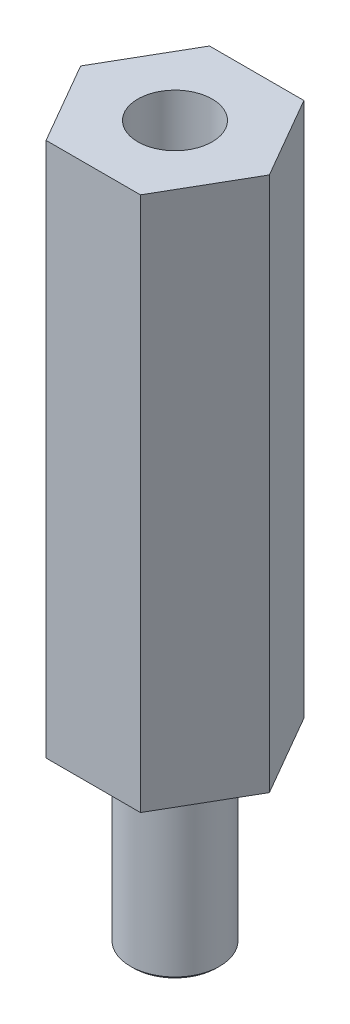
ISO-10303-21;
HEADER;
FILE_DESCRIPTION(('STEP AP214'),'2;1');
FILE_NAME('part.step','',(''),(''),'','','');
FILE_SCHEMA(('AUTOMOTIVE_DESIGN { 1 0 10303 214 1 1 1 1 }'));
ENDSEC;
DATA;
#1=APPLICATION_CONTEXT('core data for automotive mechanical design processes');
#2=APPLICATION_PROTOCOL_DEFINITION('international standard','automotive_design',2000,#1);
#3=PRODUCT_CONTEXT('',#1,'mechanical');
#4=PRODUCT('Part','Part','',(#3));
#5=PRODUCT_RELATED_PRODUCT_CATEGORY('part','',(#4));
#6=PRODUCT_DEFINITION_FORMATION('','',#4);
#7=PRODUCT_DEFINITION_CONTEXT('part definition',#1,'design');
#8=PRODUCT_DEFINITION('design','',#6,#7);
#9=PRODUCT_DEFINITION_SHAPE('','',#8);
#10=(LENGTH_UNIT() NAMED_UNIT(*) SI_UNIT(.MILLI.,.METRE.));
#11=(NAMED_UNIT(*) PLANE_ANGLE_UNIT() SI_UNIT($,.RADIAN.));
#12=(NAMED_UNIT(*) SI_UNIT($,.STERADIAN.) SOLID_ANGLE_UNIT());
#13=UNCERTAINTY_MEASURE_WITH_UNIT(LENGTH_MEASURE(1.E-05),#10,'distance_accuracy_value','');
#14=(GEOMETRIC_REPRESENTATION_CONTEXT(3) GLOBAL_UNCERTAINTY_ASSIGNED_CONTEXT((#13)) GLOBAL_UNIT_ASSIGNED_CONTEXT((#10,
#11,#12)) REPRESENTATION_CONTEXT('',''));
#15=CARTESIAN_POINT('',(0.,0.,0.));
#16=DIRECTION('',(0.,0.,1.));
#17=DIRECTION('',(1.,0.,0.));
#18=AXIS2_PLACEMENT_3D('',#15,#16,#17);
#19=CARTESIAN_POINT('',(0.,18.,0.));
#20=DIRECTION('',(0.,1.,0.));
#21=DIRECTION('',(0.,0.,1.));
#22=AXIS2_PLACEMENT_3D('',#19,#20,#21);
#23=PLANE('',#22);
#24=DIRECTION('',(0.499999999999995,0.,-0.866025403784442));
#25=VECTOR('',#24,1.);
#26=CARTESIAN_POINT('',(1.5877132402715,18.,2.74999999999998));
#27=LINE('',#26,#25);
#28=CARTESIAN_POINT('',(1.5877132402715,18.,2.74999999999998));
#29=VERTEX_POINT('',#28);
#30=CARTESIAN_POINT('',(3.17542648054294,18.,0.));
#31=VERTEX_POINT('',#30);
#32=EDGE_CURVE('E133',#29,#31,#27,.T.);
#33=ORIENTED_EDGE('',*,*,#32,.T.);
#34=DIRECTION('',(-0.500000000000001,0.,-0.866025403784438));
#35=VECTOR('',#34,1.);
#36=CARTESIAN_POINT('',(3.17542648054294,18.,0.));
#37=LINE('',#36,#35);
#38=CARTESIAN_POINT('',(1.58771324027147,18.,-2.75000000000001));
#39=VERTEX_POINT('',#38);
#40=EDGE_CURVE('E91',#31,#39,#37,.T.);
#41=ORIENTED_EDGE('',*,*,#40,.T.);
#42=DIRECTION('',(-1.,0.,0.));
#43=VECTOR('',#42,1.);
#44=CARTESIAN_POINT('',(1.58771324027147,18.,-2.75000000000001));
#45=LINE('',#44,#43);
#46=CARTESIAN_POINT('',(-1.58771324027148,18.,-2.74999999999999));
#47=VERTEX_POINT('',#46);
#48=EDGE_CURVE('E104',#39,#47,#45,.T.);
#49=ORIENTED_EDGE('',*,*,#48,.T.);
#50=DIRECTION('',(-0.499999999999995,0.,0.866025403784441));
#51=VECTOR('',#50,1.);
#52=CARTESIAN_POINT('',(-1.58771324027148,18.,-2.74999999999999));
#53=LINE('',#52,#51);
#54=CARTESIAN_POINT('',(-3.17542648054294,18.,0.));
#55=VERTEX_POINT('',#54);
#56=EDGE_CURVE('E98',#47,#55,#53,.T.);
#57=ORIENTED_EDGE('',*,*,#56,.T.);
#58=DIRECTION('',(0.500000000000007,0.,0.866025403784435));
#59=VECTOR('',#58,1.);
#60=CARTESIAN_POINT('',(-3.17542648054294,18.,0.));
#61=LINE('',#60,#59);
#62=CARTESIAN_POINT('',(-1.58771324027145,18.,2.75000000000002));
#63=VERTEX_POINT('',#62);
#64=EDGE_CURVE('E102',#55,#63,#61,.T.);
#65=ORIENTED_EDGE('',*,*,#64,.T.);
#66=DIRECTION('',(1.,0.,0.));
#67=VECTOR('',#66,1.);
#68=CARTESIAN_POINT('',(-1.58771324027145,18.,2.75000000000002));
#69=LINE('',#68,#67);
#70=EDGE_CURVE('E53',#63,#29,#69,.T.);
#71=ORIENTED_EDGE('',*,*,#70,.T.);
#72=EDGE_LOOP('',(#33,#41,#49,#57,#65,#71));
#73=FACE_BOUND('',#72,.T.);
#74=CARTESIAN_POINT('',(0.,18.,0.));
#75=DIRECTION('',(0.,1.,0.));
#76=DIRECTION('',(0.,0.,1.));
#77=AXIS2_PLACEMENT_3D('',#74,#75,#76);
#78=CIRCLE('',#77,1.25);
#79=CARTESIAN_POINT('',(0.,18.,1.25));
#80=VERTEX_POINT('',#79);
#81=EDGE_CURVE('E126',#80,#80,#78,.T.);
#82=ORIENTED_EDGE('',*,*,#81,.F.);
#83=EDGE_LOOP('',(#82));
#84=FACE_BOUND('',#83,.T.);
#85=ADVANCED_FACE('F36',(#73,#84),#23,.T.);
#86=CARTESIAN_POINT('',(0.,0.,0.));
#87=DIRECTION('',(0.,1.,0.));
#88=DIRECTION('',(0.,0.,1.));
#89=AXIS2_PLACEMENT_3D('',#86,#87,#88);
#90=PLANE('',#89);
#91=CARTESIAN_POINT('',(0.,0.,0.));
#92=DIRECTION('',(0.,1.,0.));
#93=DIRECTION('',(0.,0.,1.));
#94=AXIS2_PLACEMENT_3D('',#91,#92,#93);
#95=CIRCLE('',#94,1.5);
#96=CARTESIAN_POINT('',(0.,0.,1.5));
#97=VERTEX_POINT('',#96);
#98=EDGE_CURVE('E142',#97,#97,#95,.F.);
#99=ORIENTED_EDGE('',*,*,#98,.F.);
#100=EDGE_LOOP('',(#99));
#101=FACE_BOUND('',#100,.T.);
#102=DIRECTION('',(0.499999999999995,0.,-0.866025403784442));
#103=VECTOR('',#102,1.);
#104=CARTESIAN_POINT('',(1.5877132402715,0.,2.74999999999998));
#105=LINE('',#104,#103);
#106=CARTESIAN_POINT('',(1.5877132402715,0.,2.74999999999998));
#107=VERTEX_POINT('',#106);
#108=CARTESIAN_POINT('',(3.17542648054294,0.,0.));
#109=VERTEX_POINT('',#108);
#110=EDGE_CURVE('E122',#107,#109,#105,.T.);
#111=ORIENTED_EDGE('',*,*,#110,.F.);
#112=DIRECTION('',(1.,0.,0.));
#113=VECTOR('',#112,1.);
#114=CARTESIAN_POINT('',(-1.58771324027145,0.,2.75000000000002));
#115=LINE('',#114,#113);
#116=CARTESIAN_POINT('',(-1.58771324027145,0.,2.75000000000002));
#117=VERTEX_POINT('',#116);
#118=EDGE_CURVE('E82',#117,#107,#115,.T.);
#119=ORIENTED_EDGE('',*,*,#118,.F.);
#120=DIRECTION('',(0.500000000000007,0.,0.866025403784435));
#121=VECTOR('',#120,1.);
#122=CARTESIAN_POINT('',(-3.17542648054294,0.,0.));
#123=LINE('',#122,#121);
#124=CARTESIAN_POINT('',(-3.17542648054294,0.,0.));
#125=VERTEX_POINT('',#124);
#126=EDGE_CURVE('E76',#125,#117,#123,.T.);
#127=ORIENTED_EDGE('',*,*,#126,.F.);
#128=DIRECTION('',(-0.499999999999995,0.,0.866025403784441));
#129=VECTOR('',#128,1.);
#130=CARTESIAN_POINT('',(-1.58771324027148,0.,-2.74999999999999));
#131=LINE('',#130,#129);
#132=CARTESIAN_POINT('',(-1.58771324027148,0.,-2.74999999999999));
#133=VERTEX_POINT('',#132);
#134=EDGE_CURVE('E112',#133,#125,#131,.T.);
#135=ORIENTED_EDGE('',*,*,#134,.F.);
#136=DIRECTION('',(-1.,0.,0.));
#137=VECTOR('',#136,1.);
#138=CARTESIAN_POINT('',(1.58771324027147,0.,-2.75000000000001));
#139=LINE('',#138,#137);
#140=CARTESIAN_POINT('',(1.58771324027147,0.,-2.75000000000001));
#141=VERTEX_POINT('',#140);
#142=EDGE_CURVE('E128',#141,#133,#139,.T.);
#143=ORIENTED_EDGE('',*,*,#142,.F.);
#144=DIRECTION('',(-0.500000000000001,0.,-0.866025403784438));
#145=VECTOR('',#144,1.);
#146=CARTESIAN_POINT('',(3.17542648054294,0.,0.));
#147=LINE('',#146,#145);
#148=EDGE_CURVE('E125',#109,#141,#147,.T.);
#149=ORIENTED_EDGE('',*,*,#148,.F.);
#150=EDGE_LOOP('',(#111,#119,#127,#135,#143,#149));
#151=FACE_BOUND('',#150,.T.);
#152=ADVANCED_FACE('F158',(#101,#151),#90,.F.);
#153=CARTESIAN_POINT('',(1.5877132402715,18.,2.74999999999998));
#154=DIRECTION('',(-0.866025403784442,0.,-0.499999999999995));
#155=DIRECTION('',(-0.499999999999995,0.,0.866025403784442));
#156=AXIS2_PLACEMENT_3D('',#153,#154,#155);
#157=PLANE('',#156);
#158=ORIENTED_EDGE('',*,*,#110,.T.);
#159=DIRECTION('',(0.,-1.,0.));
#160=VECTOR('',#159,1.);
#161=CARTESIAN_POINT('',(3.17542648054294,18.,0.));
#162=LINE('',#161,#160);
#163=EDGE_CURVE('E140',#31,#109,#162,.T.);
#164=ORIENTED_EDGE('',*,*,#163,.F.);
#165=ORIENTED_EDGE('',*,*,#32,.F.);
#166=DIRECTION('',(0.,-1.,0.));
#167=VECTOR('',#166,1.);
#168=CARTESIAN_POINT('',(1.5877132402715,18.,2.74999999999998));
#169=LINE('',#168,#167);
#170=EDGE_CURVE('E118',#29,#107,#169,.T.);
#171=ORIENTED_EDGE('',*,*,#170,.T.);
#172=EDGE_LOOP('',(#158,#164,#165,#171));
#173=FACE_BOUND('',#172,.T.);
#174=ADVANCED_FACE('F163',(#173),#157,.F.);
#175=CARTESIAN_POINT('',(3.17542648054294,18.,0.));
#176=DIRECTION('',(-0.866025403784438,0.,0.500000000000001));
#177=DIRECTION('',(0.500000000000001,0.,0.866025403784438));
#178=AXIS2_PLACEMENT_3D('',#175,#176,#177);
#179=PLANE('',#178);
#180=ORIENTED_EDGE('',*,*,#148,.T.);
#181=DIRECTION('',(0.,-1.,0.));
#182=VECTOR('',#181,1.);
#183=CARTESIAN_POINT('',(1.58771324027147,18.,-2.75000000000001));
#184=LINE('',#183,#182);
#185=EDGE_CURVE('E137',#39,#141,#184,.T.);
#186=ORIENTED_EDGE('',*,*,#185,.F.);
#187=ORIENTED_EDGE('',*,*,#40,.F.);
#188=ORIENTED_EDGE('',*,*,#163,.T.);
#189=EDGE_LOOP('',(#180,#186,#187,#188));
#190=FACE_BOUND('',#189,.T.);
#191=ADVANCED_FACE('F180',(#190),#179,.F.);
#192=CARTESIAN_POINT('',(1.58771324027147,18.,-2.75000000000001));
#193=DIRECTION('',(0.,0.,1.));
#194=DIRECTION('',(1.,0.,0.));
#195=AXIS2_PLACEMENT_3D('',#192,#193,#194);
#196=PLANE('',#195);
#197=ORIENTED_EDGE('',*,*,#142,.T.);
#198=DIRECTION('',(0.,-1.,0.));
#199=VECTOR('',#198,1.);
#200=CARTESIAN_POINT('',(-1.58771324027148,18.,-2.74999999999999));
#201=LINE('',#200,#199);
#202=EDGE_CURVE('E113',#47,#133,#201,.T.);
#203=ORIENTED_EDGE('',*,*,#202,.F.);
#204=ORIENTED_EDGE('',*,*,#48,.F.);
#205=ORIENTED_EDGE('',*,*,#185,.T.);
#206=EDGE_LOOP('',(#197,#203,#204,#205));
#207=FACE_BOUND('',#206,.T.);
#208=ADVANCED_FACE('F177',(#207),#196,.F.);
#209=CARTESIAN_POINT('',(-1.58771324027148,18.,-2.74999999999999));
#210=DIRECTION('',(0.866025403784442,0.,0.499999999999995));
#211=DIRECTION('',(0.499999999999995,0.,-0.866025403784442));
#212=AXIS2_PLACEMENT_3D('',#209,#210,#211);
#213=PLANE('',#212);
#214=ORIENTED_EDGE('',*,*,#134,.T.);
#215=DIRECTION('',(0.,-1.,0.));
#216=VECTOR('',#215,1.);
#217=CARTESIAN_POINT('',(-3.17542648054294,18.,0.));
#218=LINE('',#217,#216);
#219=EDGE_CURVE('E109',#55,#125,#218,.T.);
#220=ORIENTED_EDGE('',*,*,#219,.F.);
#221=ORIENTED_EDGE('',*,*,#56,.F.);
#222=ORIENTED_EDGE('',*,*,#202,.T.);
#223=EDGE_LOOP('',(#214,#220,#221,#222));
#224=FACE_BOUND('',#223,.T.);
#225=ADVANCED_FACE('F110',(#224),#213,.F.);
#226=CARTESIAN_POINT('',(-3.17542648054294,18.,0.));
#227=DIRECTION('',(0.866025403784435,0.,-0.500000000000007));
#228=DIRECTION('',(-0.500000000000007,0.,-0.866025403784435));
#229=AXIS2_PLACEMENT_3D('',#226,#227,#228);
#230=PLANE('',#229);
#231=ORIENTED_EDGE('',*,*,#126,.T.);
#232=DIRECTION('',(0.,-1.,0.));
#233=VECTOR('',#232,1.);
#234=CARTESIAN_POINT('',(-1.58771324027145,18.,2.75000000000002));
#235=LINE('',#234,#233);
#236=EDGE_CURVE('E114',#63,#117,#235,.T.);
#237=ORIENTED_EDGE('',*,*,#236,.F.);
#238=ORIENTED_EDGE('',*,*,#64,.F.);
#239=ORIENTED_EDGE('',*,*,#219,.T.);
#240=EDGE_LOOP('',(#231,#237,#238,#239));
#241=FACE_BOUND('',#240,.T.);
#242=ADVANCED_FACE('F116',(#241),#230,.F.);
#243=CARTESIAN_POINT('',(-1.58771324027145,18.,2.75000000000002));
#244=DIRECTION('',(0.,0.,-1.));
#245=DIRECTION('',(-1.,0.,0.));
#246=AXIS2_PLACEMENT_3D('',#243,#244,#245);
#247=PLANE('',#246);
#248=ORIENTED_EDGE('',*,*,#118,.T.);
#249=ORIENTED_EDGE('',*,*,#170,.F.);
#250=ORIENTED_EDGE('',*,*,#70,.F.);
#251=ORIENTED_EDGE('',*,*,#236,.T.);
#252=EDGE_LOOP('',(#248,#249,#250,#251));
#253=FACE_BOUND('',#252,.T.);
#254=ADVANCED_FACE('F170',(#253),#247,.F.);
#255=CARTESIAN_POINT('',(0.,18.,0.));
#256=DIRECTION('',(0.,-1.,0.));
#257=DIRECTION('',(0.,0.,-1.));
#258=AXIS2_PLACEMENT_3D('',#255,#256,#257);
#259=CYLINDRICAL_SURFACE('',#258,1.25);
#260=ORIENTED_EDGE('',*,*,#81,.T.);
#261=EDGE_LOOP('',(#260));
#262=FACE_BOUND('',#261,.T.);
#263=CARTESIAN_POINT('',(0.,0.,0.));
#264=DIRECTION('',(0.,1.,0.));
#265=DIRECTION('',(0.,0.,1.));
#266=AXIS2_PLACEMENT_3D('',#263,#264,#265);
#267=CIRCLE('',#266,1.25);
#268=CARTESIAN_POINT('',(0.,0.,1.25));
#269=VERTEX_POINT('',#268);
#270=EDGE_CURVE('E195',#269,#269,#267,.T.);
#271=ORIENTED_EDGE('',*,*,#270,.F.);
#272=EDGE_LOOP('',(#271));
#273=FACE_BOUND('',#272,.T.);
#274=ADVANCED_FACE('F167',(#262,#273),#259,.F.);
#275=CARTESIAN_POINT('',(0.,0.,0.));
#276=DIRECTION('',(0.,-1.,0.));
#277=DIRECTION('',(0.,0.,-1.));
#278=AXIS2_PLACEMENT_3D('',#275,#276,#277);
#279=PLANE('',#278);
#280=ORIENTED_EDGE('',*,*,#270,.T.);
#281=EDGE_LOOP('',(#280));
#282=FACE_BOUND('',#281,.T.);
#283=ADVANCED_FACE('F203',(#282),#279,.F.);
#284=CARTESIAN_POINT('',(0.,-6.,0.));
#285=DIRECTION('',(0.,1.,0.));
#286=DIRECTION('',(0.,0.,1.));
#287=AXIS2_PLACEMENT_3D('',#284,#285,#286);
#288=CYLINDRICAL_SURFACE('',#287,1.5);
#289=CARTESIAN_POINT('',(0.,-5.9,0.));
#290=DIRECTION('',(0.,-1.,0.));
#291=DIRECTION('',(0.,0.,-1.));
#292=AXIS2_PLACEMENT_3D('',#289,#290,#291);
#293=CIRCLE('',#292,1.5);
#294=CARTESIAN_POINT('',(0.,-5.9,-1.5));
#295=VERTEX_POINT('',#294);
#296=EDGE_CURVE('E11',#295,#295,#293,.F.);
#297=ORIENTED_EDGE('',*,*,#296,.T.);
#298=EDGE_LOOP('',(#297));
#299=FACE_BOUND('',#298,.T.);
#300=ORIENTED_EDGE('',*,*,#98,.T.);
#301=EDGE_LOOP('',(#300));
#302=FACE_BOUND('',#301,.T.);
#303=ADVANCED_FACE('F154',(#299,#302),#288,.T.);
#304=CARTESIAN_POINT('',(0.,-6.,0.));
#305=DIRECTION('',(0.,-1.,0.));
#306=DIRECTION('',(0.,0.,-1.));
#307=AXIS2_PLACEMENT_3D('',#304,#305,#306);
#308=PLANE('',#307);
#309=CARTESIAN_POINT('',(0.,-6.,0.));
#310=DIRECTION('',(0.,-1.,0.));
#311=DIRECTION('',(0.,0.,-1.));
#312=AXIS2_PLACEMENT_3D('',#309,#310,#311);
#313=CIRCLE('',#312,1.40000000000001);
#314=CARTESIAN_POINT('',(0.,-6.,-1.40000000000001));
#315=VERTEX_POINT('',#314);
#316=EDGE_CURVE('E45',#315,#315,#313,.T.);
#317=ORIENTED_EDGE('',*,*,#316,.T.);
#318=EDGE_LOOP('',(#317));
#319=FACE_BOUND('',#318,.T.);
#320=ADVANCED_FACE('F147',(#319),#308,.T.);
#321=CARTESIAN_POINT('',(0.,-6.,0.));
#322=DIRECTION('',(0.,1.,0.));
#323=DIRECTION('',(0.,0.,1.));
#324=AXIS2_PLACEMENT_3D('',#321,#322,#323);
#325=CONICAL_SURFACE('',#324,1.40000000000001,0.785398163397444);
#326=ORIENTED_EDGE('',*,*,#296,.F.);
#327=EDGE_LOOP('',(#326));
#328=FACE_BOUND('',#327,.T.);
#329=ORIENTED_EDGE('',*,*,#316,.F.);
#330=EDGE_LOOP('',(#329));
#331=FACE_BOUND('',#330,.T.);
#332=ADVANCED_FACE('F38',(#328,#331),#325,.T.);
#333=CLOSED_SHELL('',(#85,#152,#174,#191,#208,#225,#242,#254,#274,#283,#303,#320,#332));
#334=MANIFOLD_SOLID_BREP('B2',#333);
#335=ADVANCED_BREP_SHAPE_REPRESENTATION('',(#18,#334),#14);
#336=SHAPE_DEFINITION_REPRESENTATION(#9,#335);
ENDSEC;
END-ISO-10303-21;
